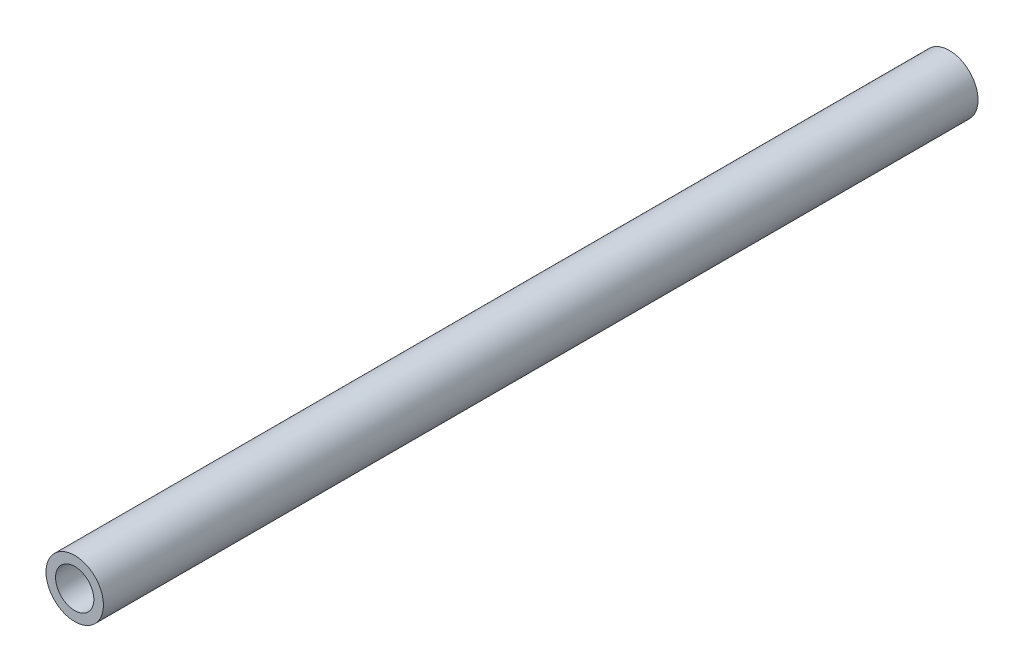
from build123d import *

# Parameters (mm, degrees)
ESQUISSE1_R        = 3
ESQUISSE1_R_2      = 2
BOSS_EXTRU_1_DEPTH = 45.7


with BuildPart() as part:
    # Esquisse1 → Boss.-Extru.1 (new, symmetric)
    with BuildSketch(Plane.XY):
        with Locations(Location((0, 0, 0), (0, 0, 180))):
            Circle(ESQUISSE1_R)
        with Locations(Location((0, 0, 0), (0, 0, 180))):
            Circle(ESQUISSE1_R_2, mode=Mode.SUBTRACT)
    extrude(amount=BOSS_EXTRU_1_DEPTH, both=True)


solid = part.part
